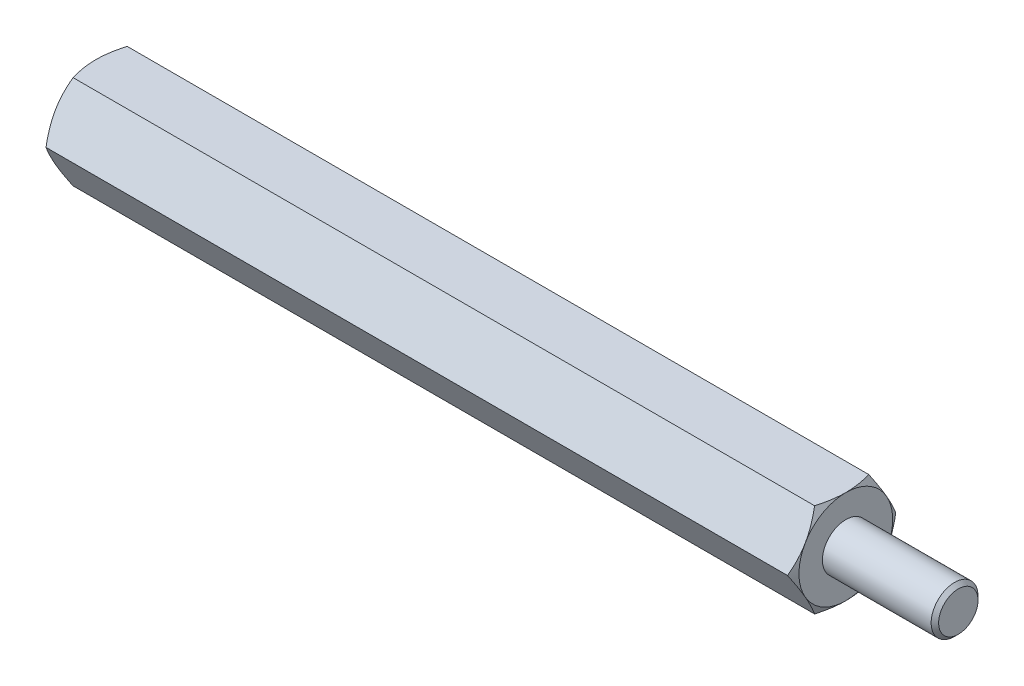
from build123d import *

# Parameters (mm, degrees)
EXTRUDE2_DEPTH = 20
SKETCH3_R      = 1.05
EXTRUDE3_DEPTH = 6
SKETCH5_R      = 1.25
EXTRUDE4_DEPTH = 6
CHAMFER1_SIZE  = 0.2


with BuildPart() as part:
    # Sketch1 → Extrude2 (new, symmetric)
    with BuildSketch(Plane(origin=(0, 0, 0), x_dir=(0, 0, -1), z_dir=(1, 0, 0))):
        Polygon((1.443375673, 2.5), (-1.443375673, 2.5), (-2.886751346, 0), (-1.443375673, -2.5), (1.443375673, -2.5), (2.886751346, 0), align=None)
    extrude(amount=EXTRUDE2_DEPTH, both=True)

    # Sketch2 → Cut-Revolve1 (revolve, cut)
    with BuildSketch(Plane.XY):
        with BuildLine():
            Line((-20, 2.5), (-18.5, 5.098076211))
            ThreePointArc((-18.5, 5.098076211), (-18.98810136, 6.276457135), (-20, 5.5))
            Line((-20, 5.5), (-20, 2.5))
        make_face()
    cut_revolve1 = revolve(axis=Axis((0, 0, 0), (1, 0, 0)), mode=Mode.SUBTRACT)

    # Mirror1: Cut-Revolve1 across plane
    add(cut_revolve1.mirror(Plane(origin=(0, 0, 0), x_dir=(0, 0, 1), z_dir=(1, 0, 0))), mode=Mode.SUBTRACT)

    # Sketch3 → Extrude3 (cut)
    with BuildSketch(Plane.ZY.offset(20)):
        Circle(SKETCH3_R)
    extrude(amount=-EXTRUDE3_DEPTH, mode=Mode.SUBTRACT)

    # Sketch4 → Cut-Revolve2 (revolve, cut)
    with BuildSketch(Plane.XY, mode=Mode.PRIVATE) as cut_revolve2_sk:
        Polygon((-14, 0), (-14, 1.05), (-13.393782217, 0), align=None)
    revolve(cut_revolve2_sk.sketch.rotate(Axis((-13.393782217, 0, 0), (-1, 0, 0)), 270), axis=Axis((-13.393782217, 0, 0), (-1, 0, 0)), mode=Mode.SUBTRACT)

    # Sketch5 → Extrude4 (add)
    with BuildSketch(Plane(origin=(20, 0, 0), x_dir=(0, 0, -1), z_dir=(1, 0, 0))):
        Circle(SKETCH5_R)
    extrude(amount=EXTRUDE4_DEPTH)

    # Chamfer1
    chamfer1_edges = [part.edges().sort_by_distance(p)[0] for p in [
        (26, 0, 1.25),
    ]]
    chamfer(chamfer1_edges, length=CHAMFER1_SIZE)


solid = part.part
